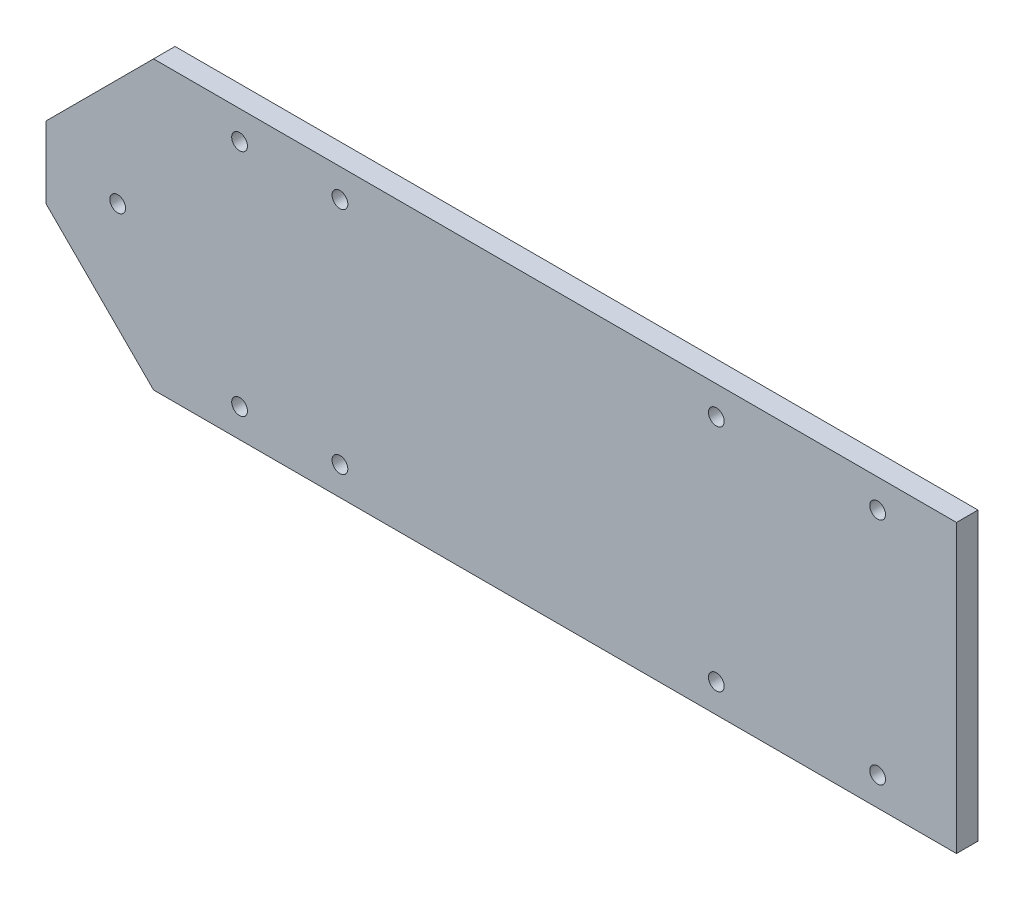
ISO-10303-21;
HEADER;
FILE_DESCRIPTION(('STEP AP214'),'2;1');
FILE_NAME('part.step','',(''),(''),'','','');
FILE_SCHEMA(('AUTOMOTIVE_DESIGN { 1 0 10303 214 1 1 1 1 }'));
ENDSEC;
DATA;
#1=APPLICATION_CONTEXT('core data for automotive mechanical design processes');
#2=APPLICATION_PROTOCOL_DEFINITION('international standard','automotive_design',2000,#1);
#3=PRODUCT_CONTEXT('',#1,'mechanical');
#4=PRODUCT('Part','Part','',(#3));
#5=PRODUCT_RELATED_PRODUCT_CATEGORY('part','',(#4));
#6=PRODUCT_DEFINITION_FORMATION('','',#4);
#7=PRODUCT_DEFINITION_CONTEXT('part definition',#1,'design');
#8=PRODUCT_DEFINITION('design','',#6,#7);
#9=PRODUCT_DEFINITION_SHAPE('','',#8);
#10=(LENGTH_UNIT() NAMED_UNIT(*) SI_UNIT(.MILLI.,.METRE.));
#11=(NAMED_UNIT(*) PLANE_ANGLE_UNIT() SI_UNIT($,.RADIAN.));
#12=(NAMED_UNIT(*) SI_UNIT($,.STERADIAN.) SOLID_ANGLE_UNIT());
#13=UNCERTAINTY_MEASURE_WITH_UNIT(LENGTH_MEASURE(1.E-05),#10,'distance_accuracy_value','');
#14=(GEOMETRIC_REPRESENTATION_CONTEXT(3) GLOBAL_UNCERTAINTY_ASSIGNED_CONTEXT((#13)) GLOBAL_UNIT_ASSIGNED_CONTEXT((#10,
#11,#12)) REPRESENTATION_CONTEXT('',''));
#15=CARTESIAN_POINT('',(0.,0.,0.));
#16=DIRECTION('',(0.,0.,1.));
#17=DIRECTION('',(1.,0.,0.));
#18=AXIS2_PLACEMENT_3D('',#15,#16,#17);
#19=CARTESIAN_POINT('',(-38.,20.,3.));
#20=DIRECTION('',(-1.,0.,0.));
#21=DIRECTION('',(0.,-1.,0.));
#22=AXIS2_PLACEMENT_3D('',#19,#20,#21);
#23=PLANE('',#22);
#24=DIRECTION('',(0.,1.,0.));
#25=VECTOR('',#24,1.);
#26=CARTESIAN_POINT('',(-38.,20.,0.));
#27=LINE('',#26,#25);
#28=CARTESIAN_POINT('',(-38.,-20.,0.));
#29=VERTEX_POINT('',#28);
#30=CARTESIAN_POINT('',(-38.,20.,0.));
#31=VERTEX_POINT('',#30);
#32=EDGE_CURVE('E82',#29,#31,#27,.T.);
#33=ORIENTED_EDGE('',*,*,#32,.T.);
#34=DIRECTION('',(0.,0.,-1.));
#35=VECTOR('',#34,1.);
#36=CARTESIAN_POINT('',(-38.,20.,3.));
#37=LINE('',#36,#35);
#38=CARTESIAN_POINT('',(-38.,20.,3.));
#39=VERTEX_POINT('',#38);
#40=EDGE_CURVE('E11',#39,#31,#37,.T.);
#41=ORIENTED_EDGE('',*,*,#40,.F.);
#42=DIRECTION('',(0.,1.,0.));
#43=VECTOR('',#42,1.);
#44=CARTESIAN_POINT('',(-38.,20.,3.));
#45=LINE('',#44,#43);
#46=CARTESIAN_POINT('',(-38.,-20.,3.));
#47=VERTEX_POINT('',#46);
#48=EDGE_CURVE('E110',#47,#39,#45,.T.);
#49=ORIENTED_EDGE('',*,*,#48,.F.);
#50=DIRECTION('',(0.,0.,-1.));
#51=VECTOR('',#50,1.);
#52=CARTESIAN_POINT('',(-38.,-20.,3.));
#53=LINE('',#52,#51);
#54=EDGE_CURVE('E95',#47,#29,#53,.T.);
#55=ORIENTED_EDGE('',*,*,#54,.T.);
#56=EDGE_LOOP('',(#33,#41,#49,#55));
#57=FACE_BOUND('',#56,.T.);
#58=ADVANCED_FACE('F26',(#57),#23,.F.);
#59=CARTESIAN_POINT('',(-150.,20.,3.));
#60=DIRECTION('',(0.,-1.,0.));
#61=DIRECTION('',(0.,0.,-1.));
#62=AXIS2_PLACEMENT_3D('',#59,#60,#61);
#63=PLANE('',#62);
#64=DIRECTION('',(-1.,0.,0.));
#65=VECTOR('',#64,1.);
#66=CARTESIAN_POINT('',(-150.,20.,0.));
#67=LINE('',#66,#65);
#68=CARTESIAN_POINT('',(-150.,20.,0.));
#69=VERTEX_POINT('',#68);
#70=EDGE_CURVE('E78',#31,#69,#67,.T.);
#71=ORIENTED_EDGE('',*,*,#70,.T.);
#72=DIRECTION('',(0.,0.,-1.));
#73=VECTOR('',#72,1.);
#74=CARTESIAN_POINT('',(-150.,20.,3.));
#75=LINE('',#74,#73);
#76=CARTESIAN_POINT('',(-150.,20.,3.));
#77=VERTEX_POINT('',#76);
#78=EDGE_CURVE('E33',#77,#69,#75,.T.);
#79=ORIENTED_EDGE('',*,*,#78,.F.);
#80=DIRECTION('',(-1.,0.,0.));
#81=VECTOR('',#80,1.);
#82=CARTESIAN_POINT('',(-150.,20.,3.));
#83=LINE('',#82,#81);
#84=EDGE_CURVE('E91',#39,#77,#83,.T.);
#85=ORIENTED_EDGE('',*,*,#84,.F.);
#86=ORIENTED_EDGE('',*,*,#40,.T.);
#87=EDGE_LOOP('',(#71,#79,#85,#86));
#88=FACE_BOUND('',#87,.T.);
#89=ADVANCED_FACE('F90',(#88),#63,.F.);
#90=CARTESIAN_POINT('',(-165.,5.,3.));
#91=DIRECTION('',(0.707106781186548,-0.707106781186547,0.));
#92=DIRECTION('',(0.707106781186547,0.707106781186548,0.));
#93=AXIS2_PLACEMENT_3D('',#90,#91,#92);
#94=PLANE('',#93);
#95=DIRECTION('',(-0.707106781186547,-0.707106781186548,0.));
#96=VECTOR('',#95,1.);
#97=CARTESIAN_POINT('',(-165.,5.,0.));
#98=LINE('',#97,#96);
#99=CARTESIAN_POINT('',(-165.,5.,0.));
#100=VERTEX_POINT('',#99);
#101=EDGE_CURVE('E84',#69,#100,#98,.T.);
#102=ORIENTED_EDGE('',*,*,#101,.T.);
#103=DIRECTION('',(0.,0.,-1.));
#104=VECTOR('',#103,1.);
#105=CARTESIAN_POINT('',(-165.,5.,3.));
#106=LINE('',#105,#104);
#107=CARTESIAN_POINT('',(-165.,5.,3.));
#108=VERTEX_POINT('',#107);
#109=EDGE_CURVE('E126',#108,#100,#106,.T.);
#110=ORIENTED_EDGE('',*,*,#109,.F.);
#111=DIRECTION('',(-0.707106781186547,-0.707106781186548,0.));
#112=VECTOR('',#111,1.);
#113=CARTESIAN_POINT('',(-165.,5.,3.));
#114=LINE('',#113,#112);
#115=EDGE_CURVE('E113',#77,#108,#114,.T.);
#116=ORIENTED_EDGE('',*,*,#115,.F.);
#117=ORIENTED_EDGE('',*,*,#78,.T.);
#118=EDGE_LOOP('',(#102,#110,#116,#117));
#119=FACE_BOUND('',#118,.T.);
#120=ADVANCED_FACE('F130',(#119),#94,.F.);
#121=CARTESIAN_POINT('',(-165.,-5.,3.));
#122=DIRECTION('',(1.,0.,0.));
#123=DIRECTION('',(0.,0.,-1.));
#124=AXIS2_PLACEMENT_3D('',#121,#122,#123);
#125=PLANE('',#124);
#126=DIRECTION('',(0.,-1.,0.));
#127=VECTOR('',#126,1.);
#128=CARTESIAN_POINT('',(-165.,-5.,0.));
#129=LINE('',#128,#127);
#130=CARTESIAN_POINT('',(-165.,-5.,0.));
#131=VERTEX_POINT('',#130);
#132=EDGE_CURVE('E104',#100,#131,#129,.T.);
#133=ORIENTED_EDGE('',*,*,#132,.T.);
#134=DIRECTION('',(0.,0.,-1.));
#135=VECTOR('',#134,1.);
#136=CARTESIAN_POINT('',(-165.,-5.,3.));
#137=LINE('',#136,#135);
#138=CARTESIAN_POINT('',(-165.,-5.,3.));
#139=VERTEX_POINT('',#138);
#140=EDGE_CURVE('E123',#139,#131,#137,.T.);
#141=ORIENTED_EDGE('',*,*,#140,.F.);
#142=DIRECTION('',(0.,-1.,0.));
#143=VECTOR('',#142,1.);
#144=CARTESIAN_POINT('',(-165.,-5.,3.));
#145=LINE('',#144,#143);
#146=EDGE_CURVE('E115',#108,#139,#145,.T.);
#147=ORIENTED_EDGE('',*,*,#146,.F.);
#148=ORIENTED_EDGE('',*,*,#109,.T.);
#149=EDGE_LOOP('',(#133,#141,#147,#148));
#150=FACE_BOUND('',#149,.T.);
#151=ADVANCED_FACE('F136',(#150),#125,.F.);
#152=CARTESIAN_POINT('',(-165.,-5.,3.));
#153=DIRECTION('',(0.707106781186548,0.707106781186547,0.));
#154=DIRECTION('',(-0.707106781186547,0.707106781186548,0.));
#155=AXIS2_PLACEMENT_3D('',#152,#153,#154);
#156=PLANE('',#155);
#157=DIRECTION('',(0.707106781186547,-0.707106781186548,0.));
#158=VECTOR('',#157,1.);
#159=CARTESIAN_POINT('',(-165.,-5.,0.));
#160=LINE('',#159,#158);
#161=CARTESIAN_POINT('',(-150.,-20.,0.));
#162=VERTEX_POINT('',#161);
#163=EDGE_CURVE('E106',#131,#162,#160,.T.);
#164=ORIENTED_EDGE('',*,*,#163,.T.);
#165=DIRECTION('',(0.,0.,-1.));
#166=VECTOR('',#165,1.);
#167=CARTESIAN_POINT('',(-150.,-20.,3.));
#168=LINE('',#167,#166);
#169=CARTESIAN_POINT('',(-150.,-20.,3.));
#170=VERTEX_POINT('',#169);
#171=EDGE_CURVE('E120',#170,#162,#168,.T.);
#172=ORIENTED_EDGE('',*,*,#171,.F.);
#173=DIRECTION('',(0.707106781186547,-0.707106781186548,0.));
#174=VECTOR('',#173,1.);
#175=CARTESIAN_POINT('',(-165.,-5.,3.));
#176=LINE('',#175,#174);
#177=EDGE_CURVE('E45',#139,#170,#176,.T.);
#178=ORIENTED_EDGE('',*,*,#177,.F.);
#179=ORIENTED_EDGE('',*,*,#140,.T.);
#180=EDGE_LOOP('',(#164,#172,#178,#179));
#181=FACE_BOUND('',#180,.T.);
#182=ADVANCED_FACE('F139',(#181),#156,.F.);
#183=CARTESIAN_POINT('',(-150.,-20.,3.));
#184=DIRECTION('',(0.,1.,0.));
#185=DIRECTION('',(-1.,0.,0.));
#186=AXIS2_PLACEMENT_3D('',#183,#184,#185);
#187=PLANE('',#186);
#188=DIRECTION('',(1.,0.,0.));
#189=VECTOR('',#188,1.);
#190=CARTESIAN_POINT('',(-150.,-20.,0.));
#191=LINE('',#190,#189);
#192=EDGE_CURVE('E108',#162,#29,#191,.T.);
#193=ORIENTED_EDGE('',*,*,#192,.T.);
#194=ORIENTED_EDGE('',*,*,#54,.F.);
#195=DIRECTION('',(1.,0.,0.));
#196=VECTOR('',#195,1.);
#197=CARTESIAN_POINT('',(-150.,-20.,3.));
#198=LINE('',#197,#196);
#199=EDGE_CURVE('E40',#170,#47,#198,.T.);
#200=ORIENTED_EDGE('',*,*,#199,.F.);
#201=ORIENTED_EDGE('',*,*,#171,.T.);
#202=EDGE_LOOP('',(#193,#194,#200,#201));
#203=FACE_BOUND('',#202,.T.);
#204=ADVANCED_FACE('F141',(#203),#187,.F.);
#205=CARTESIAN_POINT('',(-38.,20.,3.));
#206=DIRECTION('',(0.,0.,1.));
#207=DIRECTION('',(1.,0.,0.));
#208=AXIS2_PLACEMENT_3D('',#205,#206,#207);
#209=PLANE('',#208);
#210=CARTESIAN_POINT('',(-138.,-16.,3.));
#211=DIRECTION('',(0.,0.,1.));
#212=DIRECTION('',(-1.,0.,0.));
#213=AXIS2_PLACEMENT_3D('',#210,#211,#212);
#214=CIRCLE('',#213,1.09999999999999);
#215=CARTESIAN_POINT('',(-139.1,-16.,3.));
#216=VERTEX_POINT('',#215);
#217=EDGE_CURVE('E262',#216,#216,#214,.T.);
#218=ORIENTED_EDGE('',*,*,#217,.F.);
#219=EDGE_LOOP('',(#218));
#220=FACE_BOUND('',#219,.T.);
#221=CARTESIAN_POINT('',(-124.,-16.,3.));
#222=DIRECTION('',(0.,0.,1.));
#223=DIRECTION('',(-1.,0.,0.));
#224=AXIS2_PLACEMENT_3D('',#221,#222,#223);
#225=CIRCLE('',#224,1.10000000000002);
#226=CARTESIAN_POINT('',(-125.1,-16.,3.));
#227=VERTEX_POINT('',#226);
#228=EDGE_CURVE('E264',#227,#227,#225,.T.);
#229=ORIENTED_EDGE('',*,*,#228,.F.);
#230=EDGE_LOOP('',(#229));
#231=FACE_BOUND('',#230,.T.);
#232=CARTESIAN_POINT('',(-71.5,-16.,3.));
#233=DIRECTION('',(0.,0.,1.));
#234=DIRECTION('',(-1.,0.,0.));
#235=AXIS2_PLACEMENT_3D('',#232,#233,#234);
#236=CIRCLE('',#235,1.10000000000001);
#237=CARTESIAN_POINT('',(-72.6,-16.,3.));
#238=VERTEX_POINT('',#237);
#239=EDGE_CURVE('E272',#238,#238,#236,.T.);
#240=ORIENTED_EDGE('',*,*,#239,.F.);
#241=EDGE_LOOP('',(#240));
#242=FACE_BOUND('',#241,.T.);
#243=CARTESIAN_POINT('',(-49.,-16.,3.));
#244=DIRECTION('',(0.,0.,1.));
#245=DIRECTION('',(-1.,0.,0.));
#246=AXIS2_PLACEMENT_3D('',#243,#244,#245);
#247=CIRCLE('',#246,1.10000000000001);
#248=CARTESIAN_POINT('',(-50.1,-16.,3.));
#249=VERTEX_POINT('',#248);
#250=EDGE_CURVE('E278',#249,#249,#247,.T.);
#251=ORIENTED_EDGE('',*,*,#250,.F.);
#252=EDGE_LOOP('',(#251));
#253=FACE_BOUND('',#252,.T.);
#254=CARTESIAN_POINT('',(-49.,16.,3.));
#255=DIRECTION('',(0.,0.,1.));
#256=DIRECTION('',(1.,0.,0.));
#257=AXIS2_PLACEMENT_3D('',#254,#255,#256);
#258=CIRCLE('',#257,1.1);
#259=CARTESIAN_POINT('',(-47.9,16.,3.));
#260=VERTEX_POINT('',#259);
#261=EDGE_CURVE('E284',#260,#260,#258,.T.);
#262=ORIENTED_EDGE('',*,*,#261,.F.);
#263=EDGE_LOOP('',(#262));
#264=FACE_BOUND('',#263,.T.);
#265=CARTESIAN_POINT('',(-71.5,16.,3.));
#266=DIRECTION('',(0.,0.,1.));
#267=DIRECTION('',(1.,0.,0.));
#268=AXIS2_PLACEMENT_3D('',#265,#266,#267);
#269=CIRCLE('',#268,1.09999999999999);
#270=CARTESIAN_POINT('',(-70.4,16.,3.));
#271=VERTEX_POINT('',#270);
#272=EDGE_CURVE('E290',#271,#271,#269,.T.);
#273=ORIENTED_EDGE('',*,*,#272,.F.);
#274=EDGE_LOOP('',(#273));
#275=FACE_BOUND('',#274,.T.);
#276=CARTESIAN_POINT('',(-124.,16.,3.));
#277=DIRECTION('',(0.,0.,1.));
#278=DIRECTION('',(1.,0.,0.));
#279=AXIS2_PLACEMENT_3D('',#276,#277,#278);
#280=CIRCLE('',#279,1.10000000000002);
#281=CARTESIAN_POINT('',(-122.9,16.,3.));
#282=VERTEX_POINT('',#281);
#283=EDGE_CURVE('E296',#282,#282,#280,.T.);
#284=ORIENTED_EDGE('',*,*,#283,.F.);
#285=EDGE_LOOP('',(#284));
#286=FACE_BOUND('',#285,.T.);
#287=CARTESIAN_POINT('',(-138.,16.,3.));
#288=DIRECTION('',(0.,0.,1.));
#289=DIRECTION('',(1.,0.,0.));
#290=AXIS2_PLACEMENT_3D('',#287,#288,#289);
#291=CIRCLE('',#290,1.09999999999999);
#292=CARTESIAN_POINT('',(-136.9,16.,3.));
#293=VERTEX_POINT('',#292);
#294=EDGE_CURVE('E302',#293,#293,#291,.T.);
#295=ORIENTED_EDGE('',*,*,#294,.F.);
#296=EDGE_LOOP('',(#295));
#297=FACE_BOUND('',#296,.T.);
#298=CARTESIAN_POINT('',(-155.,0.,3.));
#299=DIRECTION('',(0.,0.,1.));
#300=DIRECTION('',(1.,0.,0.));
#301=AXIS2_PLACEMENT_3D('',#298,#299,#300);
#302=CIRCLE('',#301,1.09999999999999);
#303=CARTESIAN_POINT('',(-153.9,0.,3.));
#304=VERTEX_POINT('',#303);
#305=EDGE_CURVE('E99',#304,#304,#302,.T.);
#306=ORIENTED_EDGE('',*,*,#305,.F.);
#307=EDGE_LOOP('',(#306));
#308=FACE_BOUND('',#307,.T.);
#309=ORIENTED_EDGE('',*,*,#48,.T.);
#310=ORIENTED_EDGE('',*,*,#84,.T.);
#311=ORIENTED_EDGE('',*,*,#115,.T.);
#312=ORIENTED_EDGE('',*,*,#146,.T.);
#313=ORIENTED_EDGE('',*,*,#177,.T.);
#314=ORIENTED_EDGE('',*,*,#199,.T.);
#315=EDGE_LOOP('',(#309,#310,#311,#312,#313,#314));
#316=FACE_BOUND('',#315,.T.);
#317=ADVANCED_FACE('F133',(#220,#231,#242,#253,#264,#275,#286,#297,#308,#316),#209,.T.);
#318=CARTESIAN_POINT('',(-38.,20.,0.));
#319=DIRECTION('',(0.,0.,1.));
#320=DIRECTION('',(1.,0.,0.));
#321=AXIS2_PLACEMENT_3D('',#318,#319,#320);
#322=PLANE('',#321);
#323=CARTESIAN_POINT('',(-138.,-16.,0.));
#324=DIRECTION('',(0.,0.,1.));
#325=DIRECTION('',(-1.,0.,0.));
#326=AXIS2_PLACEMENT_3D('',#323,#324,#325);
#327=CIRCLE('',#326,1.09999999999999);
#328=CARTESIAN_POINT('',(-139.1,-16.,0.));
#329=VERTEX_POINT('',#328);
#330=EDGE_CURVE('E259',#329,#329,#327,.T.);
#331=ORIENTED_EDGE('',*,*,#330,.T.);
#332=EDGE_LOOP('',(#331));
#333=FACE_BOUND('',#332,.T.);
#334=CARTESIAN_POINT('',(-124.,-16.,0.));
#335=DIRECTION('',(0.,0.,1.));
#336=DIRECTION('',(-1.,0.,0.));
#337=AXIS2_PLACEMENT_3D('',#334,#335,#336);
#338=CIRCLE('',#337,1.10000000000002);
#339=CARTESIAN_POINT('',(-125.1,-16.,0.));
#340=VERTEX_POINT('',#339);
#341=EDGE_CURVE('E269',#340,#340,#338,.T.);
#342=ORIENTED_EDGE('',*,*,#341,.T.);
#343=EDGE_LOOP('',(#342));
#344=FACE_BOUND('',#343,.T.);
#345=CARTESIAN_POINT('',(-71.5,-16.,0.));
#346=DIRECTION('',(0.,0.,1.));
#347=DIRECTION('',(-1.,0.,0.));
#348=AXIS2_PLACEMENT_3D('',#345,#346,#347);
#349=CIRCLE('',#348,1.10000000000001);
#350=CARTESIAN_POINT('',(-72.6,-16.,0.));
#351=VERTEX_POINT('',#350);
#352=EDGE_CURVE('E275',#351,#351,#349,.T.);
#353=ORIENTED_EDGE('',*,*,#352,.T.);
#354=EDGE_LOOP('',(#353));
#355=FACE_BOUND('',#354,.T.);
#356=CARTESIAN_POINT('',(-49.,-16.,0.));
#357=DIRECTION('',(0.,0.,1.));
#358=DIRECTION('',(-1.,0.,0.));
#359=AXIS2_PLACEMENT_3D('',#356,#357,#358);
#360=CIRCLE('',#359,1.10000000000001);
#361=CARTESIAN_POINT('',(-50.1,-16.,0.));
#362=VERTEX_POINT('',#361);
#363=EDGE_CURVE('E281',#362,#362,#360,.T.);
#364=ORIENTED_EDGE('',*,*,#363,.T.);
#365=EDGE_LOOP('',(#364));
#366=FACE_BOUND('',#365,.T.);
#367=CARTESIAN_POINT('',(-49.,16.,0.));
#368=DIRECTION('',(0.,0.,1.));
#369=DIRECTION('',(1.,0.,0.));
#370=AXIS2_PLACEMENT_3D('',#367,#368,#369);
#371=CIRCLE('',#370,1.1);
#372=CARTESIAN_POINT('',(-47.9,16.,0.));
#373=VERTEX_POINT('',#372);
#374=EDGE_CURVE('E287',#373,#373,#371,.T.);
#375=ORIENTED_EDGE('',*,*,#374,.T.);
#376=EDGE_LOOP('',(#375));
#377=FACE_BOUND('',#376,.T.);
#378=CARTESIAN_POINT('',(-71.5,16.,0.));
#379=DIRECTION('',(0.,0.,1.));
#380=DIRECTION('',(1.,0.,0.));
#381=AXIS2_PLACEMENT_3D('',#378,#379,#380);
#382=CIRCLE('',#381,1.09999999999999);
#383=CARTESIAN_POINT('',(-70.4,16.,0.));
#384=VERTEX_POINT('',#383);
#385=EDGE_CURVE('E293',#384,#384,#382,.T.);
#386=ORIENTED_EDGE('',*,*,#385,.T.);
#387=EDGE_LOOP('',(#386));
#388=FACE_BOUND('',#387,.T.);
#389=CARTESIAN_POINT('',(-124.,16.,0.));
#390=DIRECTION('',(0.,0.,1.));
#391=DIRECTION('',(1.,0.,0.));
#392=AXIS2_PLACEMENT_3D('',#389,#390,#391);
#393=CIRCLE('',#392,1.10000000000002);
#394=CARTESIAN_POINT('',(-122.9,16.,0.));
#395=VERTEX_POINT('',#394);
#396=EDGE_CURVE('E299',#395,#395,#393,.T.);
#397=ORIENTED_EDGE('',*,*,#396,.T.);
#398=EDGE_LOOP('',(#397));
#399=FACE_BOUND('',#398,.T.);
#400=CARTESIAN_POINT('',(-138.,16.,0.));
#401=DIRECTION('',(0.,0.,1.));
#402=DIRECTION('',(1.,0.,0.));
#403=AXIS2_PLACEMENT_3D('',#400,#401,#402);
#404=CIRCLE('',#403,1.09999999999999);
#405=CARTESIAN_POINT('',(-136.9,16.,0.));
#406=VERTEX_POINT('',#405);
#407=EDGE_CURVE('E305',#406,#406,#404,.T.);
#408=ORIENTED_EDGE('',*,*,#407,.T.);
#409=EDGE_LOOP('',(#408));
#410=FACE_BOUND('',#409,.T.);
#411=CARTESIAN_POINT('',(-155.,0.,0.));
#412=DIRECTION('',(0.,0.,1.));
#413=DIRECTION('',(1.,0.,0.));
#414=AXIS2_PLACEMENT_3D('',#411,#412,#413);
#415=CIRCLE('',#414,1.09999999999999);
#416=CARTESIAN_POINT('',(-153.9,0.,0.));
#417=VERTEX_POINT('',#416);
#418=EDGE_CURVE('E96',#417,#417,#415,.T.);
#419=ORIENTED_EDGE('',*,*,#418,.T.);
#420=EDGE_LOOP('',(#419));
#421=FACE_BOUND('',#420,.T.);
#422=ORIENTED_EDGE('',*,*,#32,.F.);
#423=ORIENTED_EDGE('',*,*,#192,.F.);
#424=ORIENTED_EDGE('',*,*,#163,.F.);
#425=ORIENTED_EDGE('',*,*,#132,.F.);
#426=ORIENTED_EDGE('',*,*,#101,.F.);
#427=ORIENTED_EDGE('',*,*,#70,.F.);
#428=EDGE_LOOP('',(#422,#423,#424,#425,#426,#427));
#429=FACE_BOUND('',#428,.T.);
#430=ADVANCED_FACE('F79',(#333,#344,#355,#366,#377,#388,#399,#410,#421,#429),#322,.F.);
#431=CARTESIAN_POINT('',(-155.,0.,0.));
#432=DIRECTION('',(0.,0.,1.));
#433=DIRECTION('',(1.,0.,0.));
#434=AXIS2_PLACEMENT_3D('',#431,#432,#433);
#435=CYLINDRICAL_SURFACE('',#434,1.09999999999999);
#436=ORIENTED_EDGE('',*,*,#418,.F.);
#437=EDGE_LOOP('',(#436));
#438=FACE_BOUND('',#437,.T.);
#439=ORIENTED_EDGE('',*,*,#305,.T.);
#440=EDGE_LOOP('',(#439));
#441=FACE_BOUND('',#440,.T.);
#442=ADVANCED_FACE('F182',(#438,#441),#435,.F.);
#443=CARTESIAN_POINT('',(-138.,16.,0.));
#444=DIRECTION('',(0.,0.,1.));
#445=DIRECTION('',(1.,0.,0.));
#446=AXIS2_PLACEMENT_3D('',#443,#444,#445);
#447=CYLINDRICAL_SURFACE('',#446,1.09999999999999);
#448=ORIENTED_EDGE('',*,*,#407,.F.);
#449=EDGE_LOOP('',(#448));
#450=FACE_BOUND('',#449,.T.);
#451=ORIENTED_EDGE('',*,*,#294,.T.);
#452=EDGE_LOOP('',(#451));
#453=FACE_BOUND('',#452,.T.);
#454=ADVANCED_FACE('F190',(#450,#453),#447,.F.);
#455=CARTESIAN_POINT('',(-124.,16.,0.));
#456=DIRECTION('',(0.,0.,1.));
#457=DIRECTION('',(1.,0.,0.));
#458=AXIS2_PLACEMENT_3D('',#455,#456,#457);
#459=CYLINDRICAL_SURFACE('',#458,1.10000000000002);
#460=ORIENTED_EDGE('',*,*,#396,.F.);
#461=EDGE_LOOP('',(#460));
#462=FACE_BOUND('',#461,.T.);
#463=ORIENTED_EDGE('',*,*,#283,.T.);
#464=EDGE_LOOP('',(#463));
#465=FACE_BOUND('',#464,.T.);
#466=ADVANCED_FACE('F198',(#462,#465),#459,.F.);
#467=CARTESIAN_POINT('',(-71.5,16.,0.));
#468=DIRECTION('',(0.,0.,1.));
#469=DIRECTION('',(1.,0.,0.));
#470=AXIS2_PLACEMENT_3D('',#467,#468,#469);
#471=CYLINDRICAL_SURFACE('',#470,1.09999999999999);
#472=ORIENTED_EDGE('',*,*,#385,.F.);
#473=EDGE_LOOP('',(#472));
#474=FACE_BOUND('',#473,.T.);
#475=ORIENTED_EDGE('',*,*,#272,.T.);
#476=EDGE_LOOP('',(#475));
#477=FACE_BOUND('',#476,.T.);
#478=ADVANCED_FACE('F206',(#474,#477),#471,.F.);
#479=CARTESIAN_POINT('',(-49.,16.,0.));
#480=DIRECTION('',(0.,0.,1.));
#481=DIRECTION('',(1.,0.,0.));
#482=AXIS2_PLACEMENT_3D('',#479,#480,#481);
#483=CYLINDRICAL_SURFACE('',#482,1.1);
#484=ORIENTED_EDGE('',*,*,#374,.F.);
#485=EDGE_LOOP('',(#484));
#486=FACE_BOUND('',#485,.T.);
#487=ORIENTED_EDGE('',*,*,#261,.T.);
#488=EDGE_LOOP('',(#487));
#489=FACE_BOUND('',#488,.T.);
#490=ADVANCED_FACE('F214',(#486,#489),#483,.F.);
#491=CARTESIAN_POINT('',(-49.,-16.,0.));
#492=DIRECTION('',(0.,0.,1.));
#493=DIRECTION('',(1.,0.,0.));
#494=AXIS2_PLACEMENT_3D('',#491,#492,#493);
#495=CYLINDRICAL_SURFACE('',#494,1.10000000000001);
#496=ORIENTED_EDGE('',*,*,#363,.F.);
#497=EDGE_LOOP('',(#496));
#498=FACE_BOUND('',#497,.T.);
#499=ORIENTED_EDGE('',*,*,#250,.T.);
#500=EDGE_LOOP('',(#499));
#501=FACE_BOUND('',#500,.T.);
#502=ADVANCED_FACE('F222',(#498,#501),#495,.F.);
#503=CARTESIAN_POINT('',(-71.5,-16.,0.));
#504=DIRECTION('',(0.,0.,1.));
#505=DIRECTION('',(1.,0.,0.));
#506=AXIS2_PLACEMENT_3D('',#503,#504,#505);
#507=CYLINDRICAL_SURFACE('',#506,1.10000000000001);
#508=ORIENTED_EDGE('',*,*,#352,.F.);
#509=EDGE_LOOP('',(#508));
#510=FACE_BOUND('',#509,.T.);
#511=ORIENTED_EDGE('',*,*,#239,.T.);
#512=EDGE_LOOP('',(#511));
#513=FACE_BOUND('',#512,.T.);
#514=ADVANCED_FACE('F230',(#510,#513),#507,.F.);
#515=CARTESIAN_POINT('',(-124.,-16.,0.));
#516=DIRECTION('',(0.,0.,1.));
#517=DIRECTION('',(1.,0.,0.));
#518=AXIS2_PLACEMENT_3D('',#515,#516,#517);
#519=CYLINDRICAL_SURFACE('',#518,1.10000000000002);
#520=ORIENTED_EDGE('',*,*,#341,.F.);
#521=EDGE_LOOP('',(#520));
#522=FACE_BOUND('',#521,.T.);
#523=ORIENTED_EDGE('',*,*,#228,.T.);
#524=EDGE_LOOP('',(#523));
#525=FACE_BOUND('',#524,.T.);
#526=ADVANCED_FACE('F238',(#522,#525),#519,.F.);
#527=CARTESIAN_POINT('',(-138.,-16.,0.));
#528=DIRECTION('',(0.,0.,1.));
#529=DIRECTION('',(1.,0.,0.));
#530=AXIS2_PLACEMENT_3D('',#527,#528,#529);
#531=CYLINDRICAL_SURFACE('',#530,1.09999999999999);
#532=ORIENTED_EDGE('',*,*,#330,.F.);
#533=EDGE_LOOP('',(#532));
#534=FACE_BOUND('',#533,.T.);
#535=ORIENTED_EDGE('',*,*,#217,.T.);
#536=EDGE_LOOP('',(#535));
#537=FACE_BOUND('',#536,.T.);
#538=ADVANCED_FACE('F246',(#534,#537),#531,.F.);
#539=CLOSED_SHELL('',(#58,#89,#120,#151,#182,#204,#317,#430,#442,#454,#466,#478,#490,#502,#514,
#526,#538));
#540=MANIFOLD_SOLID_BREP('B2',#539);
#541=ADVANCED_BREP_SHAPE_REPRESENTATION('',(#18,#540),#14);
#542=SHAPE_DEFINITION_REPRESENTATION(#9,#541);
ENDSEC;
END-ISO-10303-21;
